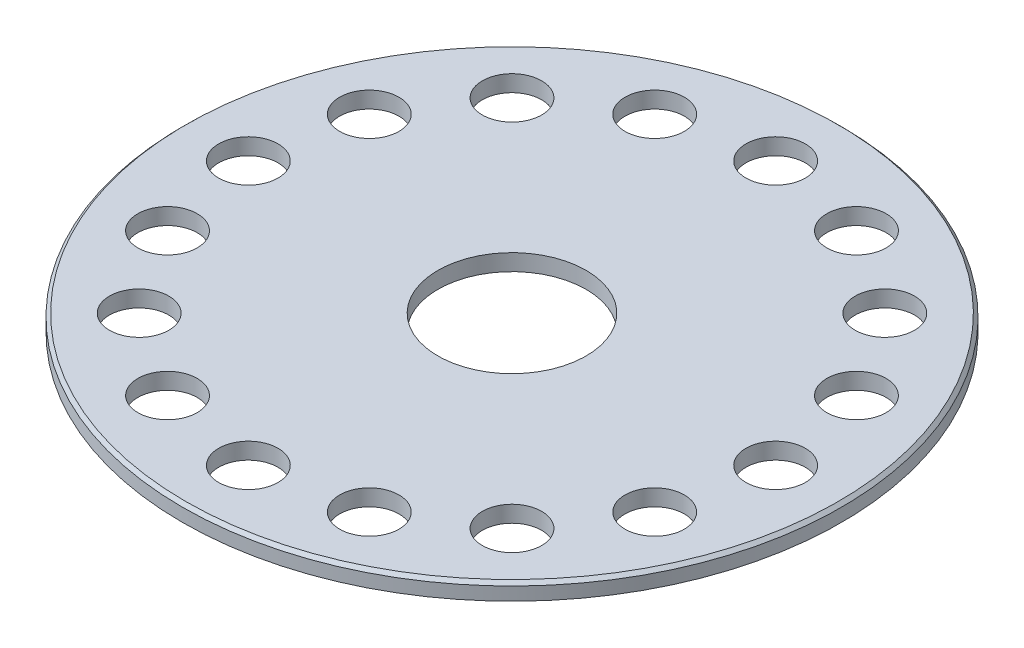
ISO-10303-21;
HEADER;
FILE_DESCRIPTION(('STEP AP214'),'2;1');
FILE_NAME('part.step','',(''),(''),'','','');
FILE_SCHEMA(('AUTOMOTIVE_DESIGN { 1 0 10303 214 1 1 1 1 }'));
ENDSEC;
DATA;
#1=APPLICATION_CONTEXT('core data for automotive mechanical design processes');
#2=APPLICATION_PROTOCOL_DEFINITION('international standard','automotive_design',2000,#1);
#3=PRODUCT_CONTEXT('',#1,'mechanical');
#4=PRODUCT('Part','Part','',(#3));
#5=PRODUCT_RELATED_PRODUCT_CATEGORY('part','',(#4));
#6=PRODUCT_DEFINITION_FORMATION('','',#4);
#7=PRODUCT_DEFINITION_CONTEXT('part definition',#1,'design');
#8=PRODUCT_DEFINITION('design','',#6,#7);
#9=PRODUCT_DEFINITION_SHAPE('','',#8);
#10=(LENGTH_UNIT() NAMED_UNIT(*) SI_UNIT(.MILLI.,.METRE.));
#11=(NAMED_UNIT(*) PLANE_ANGLE_UNIT() SI_UNIT($,.RADIAN.));
#12=(NAMED_UNIT(*) SI_UNIT($,.STERADIAN.) SOLID_ANGLE_UNIT());
#13=UNCERTAINTY_MEASURE_WITH_UNIT(LENGTH_MEASURE(1.E-05),#10,'distance_accuracy_value','');
#14=(GEOMETRIC_REPRESENTATION_CONTEXT(3) GLOBAL_UNCERTAINTY_ASSIGNED_CONTEXT((#13)) GLOBAL_UNIT_ASSIGNED_CONTEXT((#10,
#11,#12)) REPRESENTATION_CONTEXT('',''));
#15=CARTESIAN_POINT('',(0.,0.,0.));
#16=DIRECTION('',(0.,0.,1.));
#17=DIRECTION('',(1.,0.,0.));
#18=AXIS2_PLACEMENT_3D('',#15,#16,#17);
#19=CARTESIAN_POINT('',(0.,5.,0.));
#20=DIRECTION('',(0.,-1.,0.));
#21=DIRECTION('',(0.,0.,-1.));
#22=AXIS2_PLACEMENT_3D('',#19,#20,#21);
#23=CYLINDRICAL_SURFACE('',#22,100.);
#24=CARTESIAN_POINT('',(0.,3.99999999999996,0.));
#25=DIRECTION('',(0.,1.,0.));
#26=DIRECTION('',(0.,0.,1.));
#27=AXIS2_PLACEMENT_3D('',#24,#25,#26);
#28=CIRCLE('',#27,100.);
#29=CARTESIAN_POINT('',(0.,3.99999999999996,100.));
#30=VERTEX_POINT('',#29);
#31=EDGE_CURVE('E10',#30,#30,#28,.F.);
#32=ORIENTED_EDGE('',*,*,#31,.T.);
#33=EDGE_LOOP('',(#32));
#34=FACE_BOUND('',#33,.T.);
#35=CARTESIAN_POINT('',(0.,0.,0.));
#36=DIRECTION('',(0.,1.,0.));
#37=DIRECTION('',(0.,0.,1.));
#38=AXIS2_PLACEMENT_3D('',#35,#36,#37);
#39=CIRCLE('',#38,100.);
#40=CARTESIAN_POINT('',(0.,0.,100.));
#41=VERTEX_POINT('',#40);
#42=EDGE_CURVE('E59',#41,#41,#39,.T.);
#43=ORIENTED_EDGE('',*,*,#42,.T.);
#44=EDGE_LOOP('',(#43));
#45=FACE_BOUND('',#44,.T.);
#46=ADVANCED_FACE('F43',(#34,#45),#23,.T.);
#47=CARTESIAN_POINT('',(0.,5.,0.));
#48=DIRECTION('',(0.,1.,0.));
#49=DIRECTION('',(0.,0.,1.));
#50=AXIS2_PLACEMENT_3D('',#47,#48,#49);
#51=PLANE('',#50);
#52=CARTESIAN_POINT('',(0.,5.,0.));
#53=DIRECTION('',(0.,1.,0.));
#54=DIRECTION('',(0.,0.,1.));
#55=AXIS2_PLACEMENT_3D('',#52,#53,#54);
#56=CIRCLE('',#55,98.9999999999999);
#57=CARTESIAN_POINT('',(0.,5.,98.9999999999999));
#58=VERTEX_POINT('',#57);
#59=EDGE_CURVE('E52',#58,#58,#56,.T.);
#60=ORIENTED_EDGE('',*,*,#59,.T.);
#61=EDGE_LOOP('',(#60));
#62=FACE_BOUND('',#61,.T.);
#63=CARTESIAN_POINT('',(0.,5.,0.));
#64=DIRECTION('',(0.,-1.,0.));
#65=DIRECTION('',(0.,0.,-1.));
#66=AXIS2_PLACEMENT_3D('',#63,#64,#65);
#67=CIRCLE('',#66,22.5);
#68=CARTESIAN_POINT('',(0.,5.,-22.5));
#69=VERTEX_POINT('',#68);
#70=EDGE_CURVE('E154',#69,#69,#67,.T.);
#71=ORIENTED_EDGE('',*,*,#70,.T.);
#72=EDGE_LOOP('',(#71));
#73=FACE_BOUND('',#72,.T.);
#74=CARTESIAN_POINT('',(-56.5685424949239,5.,-56.5685424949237));
#75=DIRECTION('',(0.,1.,0.));
#76=DIRECTION('',(0.707106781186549,0.,0.707106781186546));
#77=AXIS2_PLACEMENT_3D('',#74,#75,#76);
#78=CIRCLE('',#77,9.);
#79=CARTESIAN_POINT('',(-50.204581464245,5.,-50.2045814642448));
#80=VERTEX_POINT('',#79);
#81=EDGE_CURVE('E142',#80,#80,#78,.T.);
#82=ORIENTED_EDGE('',*,*,#81,.F.);
#83=EDGE_LOOP('',(#82));
#84=FACE_BOUND('',#83,.T.);
#85=CARTESIAN_POINT('',(-73.910362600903,5.,-30.614674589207));
#86=DIRECTION('',(0.,1.,0.));
#87=DIRECTION('',(0.923879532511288,0.,0.382683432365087));
#88=AXIS2_PLACEMENT_3D('',#85,#86,#87);
#89=CIRCLE('',#88,9.);
#90=CARTESIAN_POINT('',(-65.5954468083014,5.,-27.1705236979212));
#91=VERTEX_POINT('',#90);
#92=EDGE_CURVE('E134',#91,#91,#89,.T.);
#93=ORIENTED_EDGE('',*,*,#92,.F.);
#94=EDGE_LOOP('',(#93));
#95=FACE_BOUND('',#94,.T.);
#96=CARTESIAN_POINT('',(-80.,5.,2.81767800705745E-13));
#97=DIRECTION('',(0.,1.,0.));
#98=DIRECTION('',(1.,0.,0.));
#99=AXIS2_PLACEMENT_3D('',#96,#97,#98);
#100=CIRCLE('',#99,9.);
#101=CARTESIAN_POINT('',(-71.,5.,2.50344468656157E-13));
#102=VERTEX_POINT('',#101);
#103=EDGE_CURVE('E126',#102,#102,#100,.T.);
#104=ORIENTED_EDGE('',*,*,#103,.F.);
#105=EDGE_LOOP('',(#104));
#106=FACE_BOUND('',#105,.T.);
#107=CARTESIAN_POINT('',(-73.9103626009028,5.,30.6146745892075));
#108=DIRECTION('',(0.,1.,0.));
#109=DIRECTION('',(0.923879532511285,0.,-0.382683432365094));
#110=AXIS2_PLACEMENT_3D('',#107,#108,#109);
#111=CIRCLE('',#110,9.);
#112=CARTESIAN_POINT('',(-65.5954468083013,5.,27.1705236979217));
#113=VERTEX_POINT('',#112);
#114=EDGE_CURVE('E118',#113,#113,#111,.T.);
#115=ORIENTED_EDGE('',*,*,#114,.F.);
#116=EDGE_LOOP('',(#115));
#117=FACE_BOUND('',#116,.T.);
#118=CARTESIAN_POINT('',(-56.5685424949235,5.,56.5685424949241));
#119=DIRECTION('',(0.,1.,0.));
#120=DIRECTION('',(0.707106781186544,0.,-0.707106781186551));
#121=AXIS2_PLACEMENT_3D('',#118,#119,#120);
#122=CIRCLE('',#121,9.);
#123=CARTESIAN_POINT('',(-50.2045814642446,5.,50.2045814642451));
#124=VERTEX_POINT('',#123);
#125=EDGE_CURVE('E110',#124,#124,#122,.T.);
#126=ORIENTED_EDGE('',*,*,#125,.F.);
#127=EDGE_LOOP('',(#126));
#128=FACE_BOUND('',#127,.T.);
#129=CARTESIAN_POINT('',(-30.6146745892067,5.,73.9103626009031));
#130=DIRECTION('',(0.,1.,0.));
#131=DIRECTION('',(0.382683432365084,0.,-0.923879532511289));
#132=AXIS2_PLACEMENT_3D('',#129,#130,#131);
#133=CIRCLE('',#132,9.);
#134=CARTESIAN_POINT('',(-27.170523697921,5.,65.5954468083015));
#135=VERTEX_POINT('',#134);
#136=EDGE_CURVE('E102',#135,#135,#133,.T.);
#137=ORIENTED_EDGE('',*,*,#136,.F.);
#138=EDGE_LOOP('',(#137));
#139=FACE_BOUND('',#138,.T.);
#140=CARTESIAN_POINT('',(0.,5.,80.));
#141=DIRECTION('',(0.,1.,0.));
#142=DIRECTION('',(0.,0.,-1.));
#143=AXIS2_PLACEMENT_3D('',#140,#141,#142);
#144=CIRCLE('',#143,9.);
#145=CARTESIAN_POINT('',(0.,5.,71.));
#146=VERTEX_POINT('',#145);
#147=EDGE_CURVE('E94',#146,#146,#144,.T.);
#148=ORIENTED_EDGE('',*,*,#147,.F.);
#149=EDGE_LOOP('',(#148));
#150=FACE_BOUND('',#149,.T.);
#151=CARTESIAN_POINT('',(30.6146745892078,5.,73.9103626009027));
#152=DIRECTION('',(0.,1.,0.));
#153=DIRECTION('',(-0.382683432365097,0.,-0.923879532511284));
#154=AXIS2_PLACEMENT_3D('',#151,#152,#153);
#155=CIRCLE('',#154,9.);
#156=CARTESIAN_POINT('',(27.1705236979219,5.,65.5954468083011));
#157=VERTEX_POINT('',#156);
#158=EDGE_CURVE('E85',#157,#157,#155,.T.);
#159=ORIENTED_EDGE('',*,*,#158,.F.);
#160=EDGE_LOOP('',(#159));
#161=FACE_BOUND('',#160,.T.);
#162=CARTESIAN_POINT('',(56.5685424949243,5.,56.5685424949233));
#163=DIRECTION('',(0.,1.,0.));
#164=DIRECTION('',(-0.707106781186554,0.,-0.707106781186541));
#165=AXIS2_PLACEMENT_3D('',#162,#163,#164);
#166=CIRCLE('',#165,9.);
#167=CARTESIAN_POINT('',(50.2045814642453,5.,50.2045814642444));
#168=VERTEX_POINT('',#167);
#169=EDGE_CURVE('E190',#168,#168,#166,.T.);
#170=ORIENTED_EDGE('',*,*,#169,.F.);
#171=EDGE_LOOP('',(#170));
#172=FACE_BOUND('',#171,.T.);
#173=CARTESIAN_POINT('',(73.9103626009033,5.,30.6146745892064));
#174=DIRECTION('',(0.,1.,0.));
#175=DIRECTION('',(-0.923879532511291,0.,-0.382683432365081));
#176=AXIS2_PLACEMENT_3D('',#173,#174,#175);
#177=CIRCLE('',#176,9.);
#178=CARTESIAN_POINT('',(65.5954468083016,5.,27.1705236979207));
#179=VERTEX_POINT('',#178);
#180=EDGE_CURVE('E182',#179,#179,#177,.T.);
#181=ORIENTED_EDGE('',*,*,#180,.F.);
#182=EDGE_LOOP('',(#181));
#183=FACE_BOUND('',#182,.T.);
#184=CARTESIAN_POINT('',(80.,5.,-8.40404814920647E-13));
#185=DIRECTION('',(0.,1.,0.));
#186=DIRECTION('',(-1.,0.,0.));
#187=AXIS2_PLACEMENT_3D('',#184,#185,#186);
#188=CIRCLE('',#187,9.);
#189=CARTESIAN_POINT('',(71.,5.,-7.46134818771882E-13));
#190=VERTEX_POINT('',#189);
#191=EDGE_CURVE('E174',#190,#190,#188,.T.);
#192=ORIENTED_EDGE('',*,*,#191,.F.);
#193=EDGE_LOOP('',(#192));
#194=FACE_BOUND('',#193,.T.);
#195=CARTESIAN_POINT('',(73.9103626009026,5.,-30.614674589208));
#196=DIRECTION('',(0.,1.,0.));
#197=DIRECTION('',(-0.923879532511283,0.,0.3826834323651));
#198=AXIS2_PLACEMENT_3D('',#195,#196,#197);
#199=CIRCLE('',#198,9.);
#200=CARTESIAN_POINT('',(65.5954468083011,5.,-27.1705236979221));
#201=VERTEX_POINT('',#200);
#202=EDGE_CURVE('E166',#201,#201,#199,.T.);
#203=ORIENTED_EDGE('',*,*,#202,.F.);
#204=EDGE_LOOP('',(#203));
#205=FACE_BOUND('',#204,.T.);
#206=CARTESIAN_POINT('',(56.5685424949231,5.,-56.5685424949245));
#207=DIRECTION('',(0.,1.,0.));
#208=DIRECTION('',(-0.707106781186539,0.,0.707106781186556));
#209=AXIS2_PLACEMENT_3D('',#206,#207,#208);
#210=CIRCLE('',#209,9.);
#211=CARTESIAN_POINT('',(50.2045814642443,5.,-50.2045814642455));
#212=VERTEX_POINT('',#211);
#213=EDGE_CURVE('E158',#212,#212,#210,.T.);
#214=ORIENTED_EDGE('',*,*,#213,.F.);
#215=EDGE_LOOP('',(#214));
#216=FACE_BOUND('',#215,.T.);
#217=CARTESIAN_POINT('',(30.6146745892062,5.,-73.9103626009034));
#218=DIRECTION('',(0.,1.,0.));
#219=DIRECTION('',(-0.382683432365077,0.,0.923879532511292));
#220=AXIS2_PLACEMENT_3D('',#217,#218,#219);
#221=CIRCLE('',#220,9.);
#222=CARTESIAN_POINT('',(27.1705236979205,5.,-65.5954468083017));
#223=VERTEX_POINT('',#222);
#224=EDGE_CURVE('E149',#223,#223,#221,.T.);
#225=ORIENTED_EDGE('',*,*,#224,.F.);
#226=EDGE_LOOP('',(#225));
#227=FACE_BOUND('',#226,.T.);
#228=CARTESIAN_POINT('',(-30.6146745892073,5.,-73.9103626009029));
#229=DIRECTION('',(0.,1.,0.));
#230=DIRECTION('',(0.382683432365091,0.,0.923879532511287));
#231=AXIS2_PLACEMENT_3D('',#228,#229,#230);
#232=CIRCLE('',#231,9.);
#233=CARTESIAN_POINT('',(-27.1705236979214,5.,-65.5954468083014));
#234=VERTEX_POINT('',#233);
#235=EDGE_CURVE('E77',#234,#234,#232,.T.);
#236=ORIENTED_EDGE('',*,*,#235,.F.);
#237=EDGE_LOOP('',(#236));
#238=FACE_BOUND('',#237,.T.);
#239=CARTESIAN_POINT('',(0.,5.,-80.));
#240=DIRECTION('',(0.,1.,0.));
#241=DIRECTION('',(0.,0.,1.));
#242=AXIS2_PLACEMENT_3D('',#239,#240,#241);
#243=CIRCLE('',#242,9.);
#244=CARTESIAN_POINT('',(0.,5.,-71.));
#245=VERTEX_POINT('',#244);
#246=EDGE_CURVE('E69',#245,#245,#243,.T.);
#247=ORIENTED_EDGE('',*,*,#246,.F.);
#248=EDGE_LOOP('',(#247));
#249=FACE_BOUND('',#248,.T.);
#250=ADVANCED_FACE('F207',(#62,#73,#84,#95,#106,#117,#128,#139,#150,#161,#172,#183,#194,#205,
#216,#227,#238,#249),#51,.T.);
#251=CARTESIAN_POINT('',(0.,0.,0.));
#252=DIRECTION('',(0.,1.,0.));
#253=DIRECTION('',(0.,0.,1.));
#254=AXIS2_PLACEMENT_3D('',#251,#252,#253);
#255=PLANE('',#254);
#256=CARTESIAN_POINT('',(0.,0.,0.));
#257=DIRECTION('',(0.,-1.,0.));
#258=DIRECTION('',(0.,0.,-1.));
#259=AXIS2_PLACEMENT_3D('',#256,#257,#258);
#260=CIRCLE('',#259,22.5);
#261=CARTESIAN_POINT('',(0.,0.,-22.5));
#262=VERTEX_POINT('',#261);
#263=EDGE_CURVE('E197',#262,#262,#260,.T.);
#264=ORIENTED_EDGE('',*,*,#263,.F.);
#265=EDGE_LOOP('',(#264));
#266=FACE_BOUND('',#265,.T.);
#267=CARTESIAN_POINT('',(-56.5685424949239,0.,-56.5685424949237));
#268=DIRECTION('',(0.,1.,0.));
#269=DIRECTION('',(0.707106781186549,0.,0.707106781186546));
#270=AXIS2_PLACEMENT_3D('',#267,#268,#269);
#271=CIRCLE('',#270,9.);
#272=CARTESIAN_POINT('',(-50.204581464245,0.,-50.2045814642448));
#273=VERTEX_POINT('',#272);
#274=EDGE_CURVE('E81',#273,#273,#271,.T.);
#275=ORIENTED_EDGE('',*,*,#274,.T.);
#276=EDGE_LOOP('',(#275));
#277=FACE_BOUND('',#276,.T.);
#278=CARTESIAN_POINT('',(-73.910362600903,0.,-30.614674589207));
#279=DIRECTION('',(0.,1.,0.));
#280=DIRECTION('',(0.923879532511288,0.,0.382683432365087));
#281=AXIS2_PLACEMENT_3D('',#278,#279,#280);
#282=CIRCLE('',#281,9.);
#283=CARTESIAN_POINT('',(-65.5954468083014,0.,-27.1705236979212));
#284=VERTEX_POINT('',#283);
#285=EDGE_CURVE('E138',#284,#284,#282,.T.);
#286=ORIENTED_EDGE('',*,*,#285,.T.);
#287=EDGE_LOOP('',(#286));
#288=FACE_BOUND('',#287,.T.);
#289=CARTESIAN_POINT('',(-80.,0.,2.81767800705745E-13));
#290=DIRECTION('',(0.,1.,0.));
#291=DIRECTION('',(1.,0.,0.));
#292=AXIS2_PLACEMENT_3D('',#289,#290,#291);
#293=CIRCLE('',#292,9.);
#294=CARTESIAN_POINT('',(-71.,0.,2.50344468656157E-13));
#295=VERTEX_POINT('',#294);
#296=EDGE_CURVE('E130',#295,#295,#293,.T.);
#297=ORIENTED_EDGE('',*,*,#296,.T.);
#298=EDGE_LOOP('',(#297));
#299=FACE_BOUND('',#298,.T.);
#300=CARTESIAN_POINT('',(-73.9103626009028,0.,30.6146745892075));
#301=DIRECTION('',(0.,1.,0.));
#302=DIRECTION('',(0.923879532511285,0.,-0.382683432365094));
#303=AXIS2_PLACEMENT_3D('',#300,#301,#302);
#304=CIRCLE('',#303,9.);
#305=CARTESIAN_POINT('',(-65.5954468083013,0.,27.1705236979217));
#306=VERTEX_POINT('',#305);
#307=EDGE_CURVE('E122',#306,#306,#304,.T.);
#308=ORIENTED_EDGE('',*,*,#307,.T.);
#309=EDGE_LOOP('',(#308));
#310=FACE_BOUND('',#309,.T.);
#311=CARTESIAN_POINT('',(-56.5685424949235,0.,56.5685424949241));
#312=DIRECTION('',(0.,1.,0.));
#313=DIRECTION('',(0.707106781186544,0.,-0.707106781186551));
#314=AXIS2_PLACEMENT_3D('',#311,#312,#313);
#315=CIRCLE('',#314,9.);
#316=CARTESIAN_POINT('',(-50.2045814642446,0.,50.2045814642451));
#317=VERTEX_POINT('',#316);
#318=EDGE_CURVE('E114',#317,#317,#315,.T.);
#319=ORIENTED_EDGE('',*,*,#318,.T.);
#320=EDGE_LOOP('',(#319));
#321=FACE_BOUND('',#320,.T.);
#322=CARTESIAN_POINT('',(-30.6146745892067,0.,73.9103626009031));
#323=DIRECTION('',(0.,1.,0.));
#324=DIRECTION('',(0.382683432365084,0.,-0.923879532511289));
#325=AXIS2_PLACEMENT_3D('',#322,#323,#324);
#326=CIRCLE('',#325,9.);
#327=CARTESIAN_POINT('',(-27.170523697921,0.,65.5954468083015));
#328=VERTEX_POINT('',#327);
#329=EDGE_CURVE('E106',#328,#328,#326,.T.);
#330=ORIENTED_EDGE('',*,*,#329,.T.);
#331=EDGE_LOOP('',(#330));
#332=FACE_BOUND('',#331,.T.);
#333=CARTESIAN_POINT('',(0.,0.,80.));
#334=DIRECTION('',(0.,1.,0.));
#335=DIRECTION('',(0.,0.,-1.));
#336=AXIS2_PLACEMENT_3D('',#333,#334,#335);
#337=CIRCLE('',#336,9.);
#338=CARTESIAN_POINT('',(0.,0.,71.));
#339=VERTEX_POINT('',#338);
#340=EDGE_CURVE('E98',#339,#339,#337,.T.);
#341=ORIENTED_EDGE('',*,*,#340,.T.);
#342=EDGE_LOOP('',(#341));
#343=FACE_BOUND('',#342,.T.);
#344=CARTESIAN_POINT('',(30.6146745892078,0.,73.9103626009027));
#345=DIRECTION('',(0.,1.,0.));
#346=DIRECTION('',(-0.382683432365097,0.,-0.923879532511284));
#347=AXIS2_PLACEMENT_3D('',#344,#345,#346);
#348=CIRCLE('',#347,9.);
#349=CARTESIAN_POINT('',(27.1705236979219,0.,65.5954468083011));
#350=VERTEX_POINT('',#349);
#351=EDGE_CURVE('E89',#350,#350,#348,.T.);
#352=ORIENTED_EDGE('',*,*,#351,.T.);
#353=EDGE_LOOP('',(#352));
#354=FACE_BOUND('',#353,.T.);
#355=CARTESIAN_POINT('',(56.5685424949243,0.,56.5685424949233));
#356=DIRECTION('',(0.,1.,0.));
#357=DIRECTION('',(-0.707106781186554,0.,-0.707106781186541));
#358=AXIS2_PLACEMENT_3D('',#355,#356,#357);
#359=CIRCLE('',#358,9.);
#360=CARTESIAN_POINT('',(50.2045814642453,0.,50.2045814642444));
#361=VERTEX_POINT('',#360);
#362=EDGE_CURVE('E90',#361,#361,#359,.T.);
#363=ORIENTED_EDGE('',*,*,#362,.T.);
#364=EDGE_LOOP('',(#363));
#365=FACE_BOUND('',#364,.T.);
#366=CARTESIAN_POINT('',(73.9103626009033,0.,30.6146745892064));
#367=DIRECTION('',(0.,1.,0.));
#368=DIRECTION('',(-0.923879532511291,0.,-0.382683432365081));
#369=AXIS2_PLACEMENT_3D('',#366,#367,#368);
#370=CIRCLE('',#369,9.);
#371=CARTESIAN_POINT('',(65.5954468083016,0.,27.1705236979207));
#372=VERTEX_POINT('',#371);
#373=EDGE_CURVE('E186',#372,#372,#370,.T.);
#374=ORIENTED_EDGE('',*,*,#373,.T.);
#375=EDGE_LOOP('',(#374));
#376=FACE_BOUND('',#375,.T.);
#377=CARTESIAN_POINT('',(80.,0.,-8.40404814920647E-13));
#378=DIRECTION('',(0.,1.,0.));
#379=DIRECTION('',(-1.,0.,0.));
#380=AXIS2_PLACEMENT_3D('',#377,#378,#379);
#381=CIRCLE('',#380,9.);
#382=CARTESIAN_POINT('',(71.,0.,-7.46134818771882E-13));
#383=VERTEX_POINT('',#382);
#384=EDGE_CURVE('E178',#383,#383,#381,.T.);
#385=ORIENTED_EDGE('',*,*,#384,.T.);
#386=EDGE_LOOP('',(#385));
#387=FACE_BOUND('',#386,.T.);
#388=CARTESIAN_POINT('',(73.9103626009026,0.,-30.614674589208));
#389=DIRECTION('',(0.,1.,0.));
#390=DIRECTION('',(-0.923879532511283,0.,0.3826834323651));
#391=AXIS2_PLACEMENT_3D('',#388,#389,#390);
#392=CIRCLE('',#391,9.);
#393=CARTESIAN_POINT('',(65.5954468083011,0.,-27.1705236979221));
#394=VERTEX_POINT('',#393);
#395=EDGE_CURVE('E170',#394,#394,#392,.T.);
#396=ORIENTED_EDGE('',*,*,#395,.T.);
#397=EDGE_LOOP('',(#396));
#398=FACE_BOUND('',#397,.T.);
#399=CARTESIAN_POINT('',(56.5685424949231,0.,-56.5685424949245));
#400=DIRECTION('',(0.,1.,0.));
#401=DIRECTION('',(-0.707106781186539,0.,0.707106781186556));
#402=AXIS2_PLACEMENT_3D('',#399,#400,#401);
#403=CIRCLE('',#402,9.);
#404=CARTESIAN_POINT('',(50.2045814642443,0.,-50.2045814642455));
#405=VERTEX_POINT('',#404);
#406=EDGE_CURVE('E162',#405,#405,#403,.T.);
#407=ORIENTED_EDGE('',*,*,#406,.T.);
#408=EDGE_LOOP('',(#407));
#409=FACE_BOUND('',#408,.T.);
#410=CARTESIAN_POINT('',(30.6146745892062,0.,-73.9103626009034));
#411=DIRECTION('',(0.,1.,0.));
#412=DIRECTION('',(-0.382683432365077,0.,0.923879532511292));
#413=AXIS2_PLACEMENT_3D('',#410,#411,#412);
#414=CIRCLE('',#413,9.);
#415=CARTESIAN_POINT('',(27.1705236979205,0.,-65.5954468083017));
#416=VERTEX_POINT('',#415);
#417=EDGE_CURVE('E153',#416,#416,#414,.T.);
#418=ORIENTED_EDGE('',*,*,#417,.T.);
#419=EDGE_LOOP('',(#418));
#420=FACE_BOUND('',#419,.T.);
#421=CARTESIAN_POINT('',(-30.6146745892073,0.,-73.9103626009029));
#422=DIRECTION('',(0.,1.,0.));
#423=DIRECTION('',(0.382683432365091,0.,0.923879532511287));
#424=AXIS2_PLACEMENT_3D('',#421,#422,#423);
#425=CIRCLE('',#424,9.);
#426=CARTESIAN_POINT('',(-27.1705236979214,0.,-65.5954468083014));
#427=VERTEX_POINT('',#426);
#428=EDGE_CURVE('E73',#427,#427,#425,.T.);
#429=ORIENTED_EDGE('',*,*,#428,.T.);
#430=EDGE_LOOP('',(#429));
#431=FACE_BOUND('',#430,.T.);
#432=CARTESIAN_POINT('',(0.,0.,-80.));
#433=DIRECTION('',(0.,1.,0.));
#434=DIRECTION('',(0.,0.,1.));
#435=AXIS2_PLACEMENT_3D('',#432,#433,#434);
#436=CIRCLE('',#435,9.);
#437=CARTESIAN_POINT('',(0.,0.,-71.));
#438=VERTEX_POINT('',#437);
#439=EDGE_CURVE('E66',#438,#438,#436,.T.);
#440=ORIENTED_EDGE('',*,*,#439,.T.);
#441=EDGE_LOOP('',(#440));
#442=FACE_BOUND('',#441,.T.);
#443=ORIENTED_EDGE('',*,*,#42,.F.);
#444=EDGE_LOOP('',(#443));
#445=FACE_BOUND('',#444,.T.);
#446=ADVANCED_FACE('F217',(#266,#277,#288,#299,#310,#321,#332,#343,#354,#365,#376,#387,#398,
#409,#420,#431,#442,#445),#255,.F.);
#447=CARTESIAN_POINT('',(0.,0.,-80.));
#448=DIRECTION('',(0.,1.,0.));
#449=DIRECTION('',(0.,0.,1.));
#450=AXIS2_PLACEMENT_3D('',#447,#448,#449);
#451=CYLINDRICAL_SURFACE('',#450,9.);
#452=ORIENTED_EDGE('',*,*,#439,.F.);
#453=EDGE_LOOP('',(#452));
#454=FACE_BOUND('',#453,.T.);
#455=ORIENTED_EDGE('',*,*,#246,.T.);
#456=EDGE_LOOP('',(#455));
#457=FACE_BOUND('',#456,.T.);
#458=ADVANCED_FACE('F220',(#454,#457),#451,.F.);
#459=CARTESIAN_POINT('',(-30.6146745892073,0.,-73.9103626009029));
#460=DIRECTION('',(0.,1.,0.));
#461=DIRECTION('',(0.,0.,1.));
#462=AXIS2_PLACEMENT_3D('',#459,#460,#461);
#463=CYLINDRICAL_SURFACE('',#462,9.);
#464=ORIENTED_EDGE('',*,*,#428,.F.);
#465=EDGE_LOOP('',(#464));
#466=FACE_BOUND('',#465,.T.);
#467=ORIENTED_EDGE('',*,*,#235,.T.);
#468=EDGE_LOOP('',(#467));
#469=FACE_BOUND('',#468,.T.);
#470=ADVANCED_FACE('F264',(#466,#469),#463,.F.);
#471=CARTESIAN_POINT('',(30.6146745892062,0.,-73.9103626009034));
#472=DIRECTION('',(0.,1.,0.));
#473=DIRECTION('',(0.,0.,1.));
#474=AXIS2_PLACEMENT_3D('',#471,#472,#473);
#475=CYLINDRICAL_SURFACE('',#474,9.);
#476=ORIENTED_EDGE('',*,*,#417,.F.);
#477=EDGE_LOOP('',(#476));
#478=FACE_BOUND('',#477,.T.);
#479=ORIENTED_EDGE('',*,*,#224,.T.);
#480=EDGE_LOOP('',(#479));
#481=FACE_BOUND('',#480,.T.);
#482=ADVANCED_FACE('F268',(#478,#481),#475,.F.);
#483=CARTESIAN_POINT('',(56.5685424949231,0.,-56.5685424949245));
#484=DIRECTION('',(0.,1.,0.));
#485=DIRECTION('',(0.,0.,1.));
#486=AXIS2_PLACEMENT_3D('',#483,#484,#485);
#487=CYLINDRICAL_SURFACE('',#486,9.);
#488=ORIENTED_EDGE('',*,*,#406,.F.);
#489=EDGE_LOOP('',(#488));
#490=FACE_BOUND('',#489,.T.);
#491=ORIENTED_EDGE('',*,*,#213,.T.);
#492=EDGE_LOOP('',(#491));
#493=FACE_BOUND('',#492,.T.);
#494=ADVANCED_FACE('F304',(#490,#493),#487,.F.);
#495=CARTESIAN_POINT('',(73.9103626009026,0.,-30.614674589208));
#496=DIRECTION('',(0.,1.,0.));
#497=DIRECTION('',(0.,0.,1.));
#498=AXIS2_PLACEMENT_3D('',#495,#496,#497);
#499=CYLINDRICAL_SURFACE('',#498,9.);
#500=ORIENTED_EDGE('',*,*,#395,.F.);
#501=EDGE_LOOP('',(#500));
#502=FACE_BOUND('',#501,.T.);
#503=ORIENTED_EDGE('',*,*,#202,.T.);
#504=EDGE_LOOP('',(#503));
#505=FACE_BOUND('',#504,.T.);
#506=ADVANCED_FACE('F308',(#502,#505),#499,.F.);
#507=CARTESIAN_POINT('',(80.,0.,-8.40404814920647E-13));
#508=DIRECTION('',(0.,1.,0.));
#509=DIRECTION('',(0.,0.,1.));
#510=AXIS2_PLACEMENT_3D('',#507,#508,#509);
#511=CYLINDRICAL_SURFACE('',#510,9.);
#512=ORIENTED_EDGE('',*,*,#384,.F.);
#513=EDGE_LOOP('',(#512));
#514=FACE_BOUND('',#513,.T.);
#515=ORIENTED_EDGE('',*,*,#191,.T.);
#516=EDGE_LOOP('',(#515));
#517=FACE_BOUND('',#516,.T.);
#518=ADVANCED_FACE('F312',(#514,#517),#511,.F.);
#519=CARTESIAN_POINT('',(73.9103626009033,0.,30.6146745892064));
#520=DIRECTION('',(0.,1.,0.));
#521=DIRECTION('',(0.,0.,1.));
#522=AXIS2_PLACEMENT_3D('',#519,#520,#521);
#523=CYLINDRICAL_SURFACE('',#522,9.);
#524=ORIENTED_EDGE('',*,*,#373,.F.);
#525=EDGE_LOOP('',(#524));
#526=FACE_BOUND('',#525,.T.);
#527=ORIENTED_EDGE('',*,*,#180,.T.);
#528=EDGE_LOOP('',(#527));
#529=FACE_BOUND('',#528,.T.);
#530=ADVANCED_FACE('F316',(#526,#529),#523,.F.);
#531=CARTESIAN_POINT('',(56.5685424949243,0.,56.5685424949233));
#532=DIRECTION('',(0.,1.,0.));
#533=DIRECTION('',(0.,0.,1.));
#534=AXIS2_PLACEMENT_3D('',#531,#532,#533);
#535=CYLINDRICAL_SURFACE('',#534,9.);
#536=ORIENTED_EDGE('',*,*,#362,.F.);
#537=EDGE_LOOP('',(#536));
#538=FACE_BOUND('',#537,.T.);
#539=ORIENTED_EDGE('',*,*,#169,.T.);
#540=EDGE_LOOP('',(#539));
#541=FACE_BOUND('',#540,.T.);
#542=ADVANCED_FACE('F274',(#538,#541),#535,.F.);
#543=CARTESIAN_POINT('',(30.6146745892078,0.,73.9103626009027));
#544=DIRECTION('',(0.,1.,0.));
#545=DIRECTION('',(0.,0.,1.));
#546=AXIS2_PLACEMENT_3D('',#543,#544,#545);
#547=CYLINDRICAL_SURFACE('',#546,9.);
#548=ORIENTED_EDGE('',*,*,#351,.F.);
#549=EDGE_LOOP('',(#548));
#550=FACE_BOUND('',#549,.T.);
#551=ORIENTED_EDGE('',*,*,#158,.T.);
#552=EDGE_LOOP('',(#551));
#553=FACE_BOUND('',#552,.T.);
#554=ADVANCED_FACE('F270',(#550,#553),#547,.F.);
#555=CARTESIAN_POINT('',(0.,0.,80.));
#556=DIRECTION('',(0.,1.,0.));
#557=DIRECTION('',(0.,0.,1.));
#558=AXIS2_PLACEMENT_3D('',#555,#556,#557);
#559=CYLINDRICAL_SURFACE('',#558,9.);
#560=ORIENTED_EDGE('',*,*,#340,.F.);
#561=EDGE_LOOP('',(#560));
#562=FACE_BOUND('',#561,.T.);
#563=ORIENTED_EDGE('',*,*,#147,.T.);
#564=EDGE_LOOP('',(#563));
#565=FACE_BOUND('',#564,.T.);
#566=ADVANCED_FACE('F273',(#562,#565),#559,.F.);
#567=CARTESIAN_POINT('',(-30.6146745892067,0.,73.9103626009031));
#568=DIRECTION('',(0.,1.,0.));
#569=DIRECTION('',(0.,0.,1.));
#570=AXIS2_PLACEMENT_3D('',#567,#568,#569);
#571=CYLINDRICAL_SURFACE('',#570,9.);
#572=ORIENTED_EDGE('',*,*,#329,.F.);
#573=EDGE_LOOP('',(#572));
#574=FACE_BOUND('',#573,.T.);
#575=ORIENTED_EDGE('',*,*,#136,.T.);
#576=EDGE_LOOP('',(#575));
#577=FACE_BOUND('',#576,.T.);
#578=ADVANCED_FACE('F278',(#574,#577),#571,.F.);
#579=CARTESIAN_POINT('',(-56.5685424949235,0.,56.5685424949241));
#580=DIRECTION('',(0.,1.,0.));
#581=DIRECTION('',(0.,0.,1.));
#582=AXIS2_PLACEMENT_3D('',#579,#580,#581);
#583=CYLINDRICAL_SURFACE('',#582,9.);
#584=ORIENTED_EDGE('',*,*,#318,.F.);
#585=EDGE_LOOP('',(#584));
#586=FACE_BOUND('',#585,.T.);
#587=ORIENTED_EDGE('',*,*,#125,.T.);
#588=EDGE_LOOP('',(#587));
#589=FACE_BOUND('',#588,.T.);
#590=ADVANCED_FACE('F282',(#586,#589),#583,.F.);
#591=CARTESIAN_POINT('',(-73.9103626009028,0.,30.6146745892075));
#592=DIRECTION('',(0.,1.,0.));
#593=DIRECTION('',(0.,0.,1.));
#594=AXIS2_PLACEMENT_3D('',#591,#592,#593);
#595=CYLINDRICAL_SURFACE('',#594,9.);
#596=ORIENTED_EDGE('',*,*,#307,.F.);
#597=EDGE_LOOP('',(#596));
#598=FACE_BOUND('',#597,.T.);
#599=ORIENTED_EDGE('',*,*,#114,.T.);
#600=EDGE_LOOP('',(#599));
#601=FACE_BOUND('',#600,.T.);
#602=ADVANCED_FACE('F286',(#598,#601),#595,.F.);
#603=CARTESIAN_POINT('',(-80.,0.,2.81767800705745E-13));
#604=DIRECTION('',(0.,1.,0.));
#605=DIRECTION('',(0.,0.,1.));
#606=AXIS2_PLACEMENT_3D('',#603,#604,#605);
#607=CYLINDRICAL_SURFACE('',#606,9.);
#608=ORIENTED_EDGE('',*,*,#296,.F.);
#609=EDGE_LOOP('',(#608));
#610=FACE_BOUND('',#609,.T.);
#611=ORIENTED_EDGE('',*,*,#103,.T.);
#612=EDGE_LOOP('',(#611));
#613=FACE_BOUND('',#612,.T.);
#614=ADVANCED_FACE('F290',(#610,#613),#607,.F.);
#615=CARTESIAN_POINT('',(-73.910362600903,0.,-30.614674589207));
#616=DIRECTION('',(0.,1.,0.));
#617=DIRECTION('',(0.,0.,1.));
#618=AXIS2_PLACEMENT_3D('',#615,#616,#617);
#619=CYLINDRICAL_SURFACE('',#618,9.);
#620=ORIENTED_EDGE('',*,*,#285,.F.);
#621=EDGE_LOOP('',(#620));
#622=FACE_BOUND('',#621,.T.);
#623=ORIENTED_EDGE('',*,*,#92,.T.);
#624=EDGE_LOOP('',(#623));
#625=FACE_BOUND('',#624,.T.);
#626=ADVANCED_FACE('F294',(#622,#625),#619,.F.);
#627=CARTESIAN_POINT('',(-56.5685424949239,0.,-56.5685424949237));
#628=DIRECTION('',(0.,1.,0.));
#629=DIRECTION('',(0.,0.,1.));
#630=AXIS2_PLACEMENT_3D('',#627,#628,#629);
#631=CYLINDRICAL_SURFACE('',#630,9.);
#632=ORIENTED_EDGE('',*,*,#274,.F.);
#633=EDGE_LOOP('',(#632));
#634=FACE_BOUND('',#633,.T.);
#635=ORIENTED_EDGE('',*,*,#81,.T.);
#636=EDGE_LOOP('',(#635));
#637=FACE_BOUND('',#636,.T.);
#638=ADVANCED_FACE('F213',(#634,#637),#631,.F.);
#639=CARTESIAN_POINT('',(0.,5.,0.));
#640=DIRECTION('',(0.,-1.,0.));
#641=DIRECTION('',(0.,0.,-1.));
#642=AXIS2_PLACEMENT_3D('',#639,#640,#641);
#643=CYLINDRICAL_SURFACE('',#642,22.5);
#644=ORIENTED_EDGE('',*,*,#70,.F.);
#645=EDGE_LOOP('',(#644));
#646=FACE_BOUND('',#645,.T.);
#647=ORIENTED_EDGE('',*,*,#263,.T.);
#648=EDGE_LOOP('',(#647));
#649=FACE_BOUND('',#648,.T.);
#650=ADVANCED_FACE('F210',(#646,#649),#643,.F.);
#651=CARTESIAN_POINT('',(0.,5.,0.));
#652=DIRECTION('',(0.,-1.,0.));
#653=DIRECTION('',(0.,0.,-1.));
#654=AXIS2_PLACEMENT_3D('',#651,#652,#653);
#655=CONICAL_SURFACE('',#654,98.9999999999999,0.785398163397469);
#656=ORIENTED_EDGE('',*,*,#31,.F.);
#657=EDGE_LOOP('',(#656));
#658=FACE_BOUND('',#657,.T.);
#659=ORIENTED_EDGE('',*,*,#59,.F.);
#660=EDGE_LOOP('',(#659));
#661=FACE_BOUND('',#660,.T.);
#662=ADVANCED_FACE('F46',(#658,#661),#655,.T.);
#663=CLOSED_SHELL('',(#46,#250,#446,#458,#470,#482,#494,#506,#518,#530,#542,#554,#566,#578,#590,
#602,#614,#626,#638,#650,#662));
#664=MANIFOLD_SOLID_BREP('B2',#663);
#665=ADVANCED_BREP_SHAPE_REPRESENTATION('',(#18,#664),#14);
#666=SHAPE_DEFINITION_REPRESENTATION(#9,#665);
ENDSEC;
END-ISO-10303-21;
